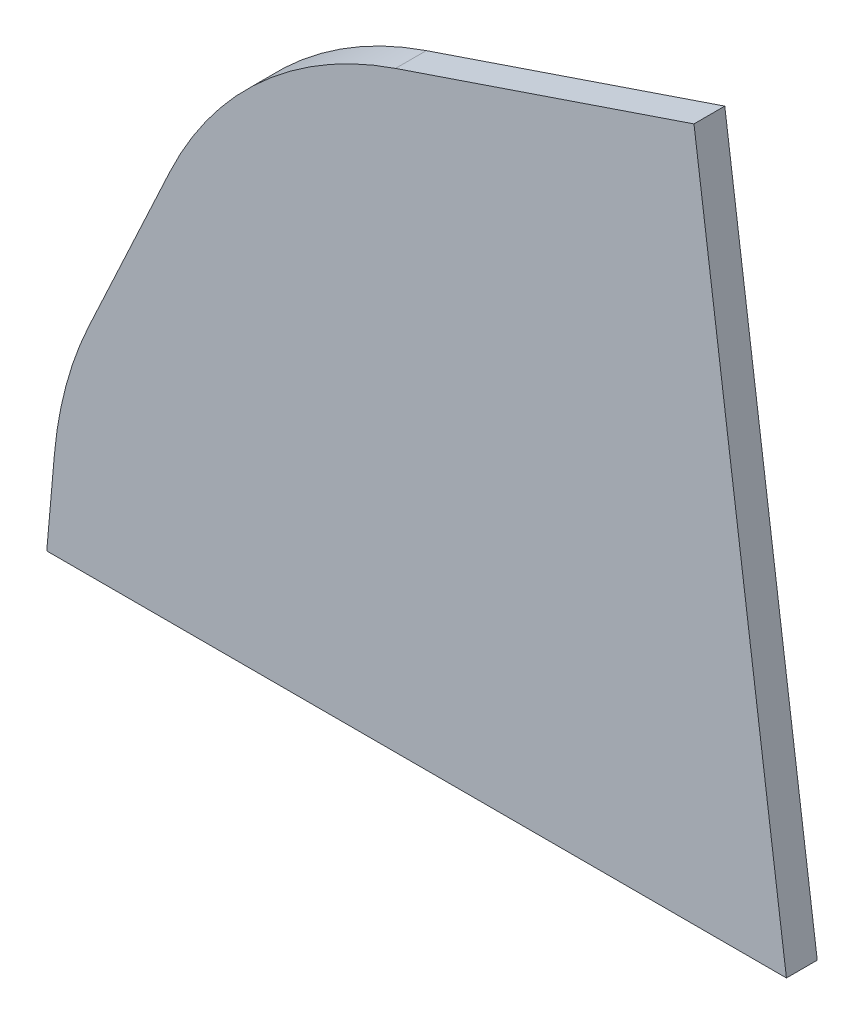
ISO-10303-21;
HEADER;
FILE_DESCRIPTION(('STEP AP214'),'2;1');
FILE_NAME('part.step','',(''),(''),'','','');
FILE_SCHEMA(('AUTOMOTIVE_DESIGN { 1 0 10303 214 1 1 1 1 }'));
ENDSEC;
DATA;
#1=APPLICATION_CONTEXT('core data for automotive mechanical design processes');
#2=APPLICATION_PROTOCOL_DEFINITION('international standard','automotive_design',2000,#1);
#3=PRODUCT_CONTEXT('',#1,'mechanical');
#4=PRODUCT('Part','Part','',(#3));
#5=PRODUCT_RELATED_PRODUCT_CATEGORY('part','',(#4));
#6=PRODUCT_DEFINITION_FORMATION('','',#4);
#7=PRODUCT_DEFINITION_CONTEXT('part definition',#1,'design');
#8=PRODUCT_DEFINITION('design','',#6,#7);
#9=PRODUCT_DEFINITION_SHAPE('','',#8);
#10=(LENGTH_UNIT() NAMED_UNIT(*) SI_UNIT(.MILLI.,.METRE.));
#11=(NAMED_UNIT(*) PLANE_ANGLE_UNIT() SI_UNIT($,.RADIAN.));
#12=(NAMED_UNIT(*) SI_UNIT($,.STERADIAN.) SOLID_ANGLE_UNIT());
#13=UNCERTAINTY_MEASURE_WITH_UNIT(LENGTH_MEASURE(1.E-05),#10,'distance_accuracy_value','');
#14=(GEOMETRIC_REPRESENTATION_CONTEXT(3) GLOBAL_UNCERTAINTY_ASSIGNED_CONTEXT((#13)) GLOBAL_UNIT_ASSIGNED_CONTEXT((#10,
#11,#12)) REPRESENTATION_CONTEXT('',''));
#15=CARTESIAN_POINT('',(0.,0.,0.));
#16=DIRECTION('',(0.,0.,1.));
#17=DIRECTION('',(1.,0.,0.));
#18=AXIS2_PLACEMENT_3D('',#15,#16,#17);
#19=CARTESIAN_POINT('',(-96.,0.,2.));
#20=DIRECTION('',(0.,1.,0.));
#21=DIRECTION('',(0.,0.,1.));
#22=AXIS2_PLACEMENT_3D('',#19,#20,#21);
#23=PLANE('',#22);
#24=DIRECTION('',(1.,0.,0.));
#25=VECTOR('',#24,1.);
#26=CARTESIAN_POINT('',(-96.,0.,-2.));
#27=LINE('',#26,#25);
#28=CARTESIAN_POINT('',(-96.,0.,-2.));
#29=VERTEX_POINT('',#28);
#30=CARTESIAN_POINT('',(0.,0.,-2.));
#31=VERTEX_POINT('',#30);
#32=EDGE_CURVE('E116',#29,#31,#27,.T.);
#33=ORIENTED_EDGE('',*,*,#32,.T.);
#34=DIRECTION('',(0.,0.,-1.));
#35=VECTOR('',#34,1.);
#36=CARTESIAN_POINT('',(0.,0.,2.));
#37=LINE('',#36,#35);
#38=CARTESIAN_POINT('',(0.,0.,2.));
#39=VERTEX_POINT('',#38);
#40=EDGE_CURVE('E100',#39,#31,#37,.T.);
#41=ORIENTED_EDGE('',*,*,#40,.F.);
#42=DIRECTION('',(1.,0.,0.));
#43=VECTOR('',#42,1.);
#44=CARTESIAN_POINT('',(-96.,0.,2.));
#45=LINE('',#44,#43);
#46=CARTESIAN_POINT('',(-96.,0.,2.));
#47=VERTEX_POINT('',#46);
#48=EDGE_CURVE('E105',#47,#39,#45,.T.);
#49=ORIENTED_EDGE('',*,*,#48,.F.);
#50=DIRECTION('',(0.,0.,-1.));
#51=VECTOR('',#50,1.);
#52=CARTESIAN_POINT('',(-96.,0.,2.));
#53=LINE('',#52,#51);
#54=EDGE_CURVE('E121',#47,#29,#53,.T.);
#55=ORIENTED_EDGE('',*,*,#54,.T.);
#56=EDGE_LOOP('',(#33,#41,#49,#55));
#57=FACE_BOUND('',#56,.T.);
#58=ADVANCED_FACE('F34',(#57),#23,.F.);
#59=CARTESIAN_POINT('',(0.,0.,2.));
#60=DIRECTION('',(-0.991227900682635,-0.132163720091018,0.));
#61=DIRECTION('',(0.132163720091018,-0.991227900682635,0.));
#62=AXIS2_PLACEMENT_3D('',#59,#60,#61);
#63=PLANE('',#62);
#64=DIRECTION('',(-0.132163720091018,0.991227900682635,0.));
#65=VECTOR('',#64,1.);
#66=CARTESIAN_POINT('',(0.,0.,-2.));
#67=LINE('',#66,#65);
#68=CARTESIAN_POINT('',(-12.,90.,-2.));
#69=VERTEX_POINT('',#68);
#70=EDGE_CURVE('E150',#31,#69,#67,.T.);
#71=ORIENTED_EDGE('',*,*,#70,.T.);
#72=DIRECTION('',(0.,0.,-1.));
#73=VECTOR('',#72,1.);
#74=CARTESIAN_POINT('',(-12.,90.,2.));
#75=LINE('',#74,#73);
#76=CARTESIAN_POINT('',(-12.,90.,2.));
#77=VERTEX_POINT('',#76);
#78=EDGE_CURVE('E103',#77,#69,#75,.T.);
#79=ORIENTED_EDGE('',*,*,#78,.F.);
#80=DIRECTION('',(-0.132163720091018,0.991227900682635,0.));
#81=VECTOR('',#80,1.);
#82=CARTESIAN_POINT('',(0.,0.,2.));
#83=LINE('',#82,#81);
#84=EDGE_CURVE('E96',#39,#77,#83,.T.);
#85=ORIENTED_EDGE('',*,*,#84,.F.);
#86=ORIENTED_EDGE('',*,*,#40,.T.);
#87=EDGE_LOOP('',(#71,#79,#85,#86));
#88=FACE_BOUND('',#87,.T.);
#89=ADVANCED_FACE('F98',(#88),#63,.F.);
#90=CARTESIAN_POINT('',(-12.,90.,2.));
#91=DIRECTION('',(0.321039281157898,-0.947065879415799,0.));
#92=DIRECTION('',(0.947065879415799,0.321039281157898,0.));
#93=AXIS2_PLACEMENT_3D('',#90,#91,#92);
#94=PLANE('',#93);
#95=DIRECTION('',(-0.947065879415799,-0.321039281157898,0.));
#96=VECTOR('',#95,1.);
#97=CARTESIAN_POINT('',(-12.,90.,-2.));
#98=LINE('',#97,#96);
#99=CARTESIAN_POINT('',(-50.7358599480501,76.8692000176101,-2.));
#100=VERTEX_POINT('',#99);
#101=EDGE_CURVE('E147',#69,#100,#98,.T.);
#102=ORIENTED_EDGE('',*,*,#101,.T.);
#103=DIRECTION('',(0.,0.,-1.));
#104=VECTOR('',#103,1.);
#105=CARTESIAN_POINT('',(-50.7358599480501,76.8692000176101,2.));
#106=LINE('',#105,#104);
#107=CARTESIAN_POINT('',(-50.7358599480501,76.8692000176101,2.));
#108=VERTEX_POINT('',#107);
#109=EDGE_CURVE('E57',#100,#108,#106,.F.);
#110=ORIENTED_EDGE('',*,*,#109,.T.);
#111=DIRECTION('',(-0.947065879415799,-0.321039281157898,0.));
#112=VECTOR('',#111,1.);
#113=CARTESIAN_POINT('',(-12.,90.,2.));
#114=LINE('',#113,#112);
#115=EDGE_CURVE('E104',#77,#108,#114,.T.);
#116=ORIENTED_EDGE('',*,*,#115,.F.);
#117=ORIENTED_EDGE('',*,*,#78,.T.);
#118=EDGE_LOOP('',(#102,#110,#116,#117));
#119=FACE_BOUND('',#118,.T.);
#120=ADVANCED_FACE('F149',(#119),#94,.F.);
#121=CARTESIAN_POINT('',(-71.,70.,2.));
#122=DIRECTION('',(0.906759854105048,-0.421647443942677,0.));
#123=DIRECTION('',(0.421647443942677,0.906759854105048,0.));
#124=AXIS2_PLACEMENT_3D('',#121,#122,#123);
#125=PLANE('',#124);
#126=DIRECTION('',(-0.421647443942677,-0.906759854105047,0.));
#127=VECTOR('',#126,1.);
#128=CARTESIAN_POINT('',(-71.,70.,2.));
#129=LINE('',#128,#127);
#130=CARTESIAN_POINT('',(-80.0218885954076,50.598278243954,2.));
#131=VERTEX_POINT('',#130);
#132=CARTESIAN_POINT('',(-90.5444742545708,27.9692824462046,2.));
#133=VERTEX_POINT('',#132);
#134=EDGE_CURVE('E134',#131,#133,#129,.T.);
#135=ORIENTED_EDGE('',*,*,#134,.F.);
#136=DIRECTION('',(0.,0.,-1.));
#137=VECTOR('',#136,1.);
#138=CARTESIAN_POINT('',(-80.0218885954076,50.598278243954,2.));
#139=LINE('',#138,#137);
#140=CARTESIAN_POINT('',(-80.0218885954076,50.598278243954,-2.));
#141=VERTEX_POINT('',#140);
#142=EDGE_CURVE('E119',#131,#141,#139,.T.);
#143=ORIENTED_EDGE('',*,*,#142,.T.);
#144=DIRECTION('',(-0.421647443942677,-0.906759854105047,0.));
#145=VECTOR('',#144,1.);
#146=CARTESIAN_POINT('',(-71.,70.,-2.));
#147=LINE('',#146,#145);
#148=CARTESIAN_POINT('',(-90.5444742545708,27.9692824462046,-2.));
#149=VERTEX_POINT('',#148);
#150=EDGE_CURVE('E148',#141,#149,#147,.T.);
#151=ORIENTED_EDGE('',*,*,#150,.T.);
#152=DIRECTION('',(0.,0.,-1.));
#153=VECTOR('',#152,1.);
#154=CARTESIAN_POINT('',(-90.5444742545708,27.9692824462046,2.));
#155=LINE('',#154,#153);
#156=EDGE_CURVE('E117',#149,#133,#155,.F.);
#157=ORIENTED_EDGE('',*,*,#156,.T.);
#158=EDGE_LOOP('',(#135,#143,#151,#157));
#159=FACE_BOUND('',#158,.T.);
#160=ADVANCED_FACE('F138',(#159),#125,.F.);
#161=CARTESIAN_POINT('',(-94.2502267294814,20.,2.));
#162=DIRECTION('',(0.996194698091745,-0.0871557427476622,0.));
#163=DIRECTION('',(0.0871557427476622,0.996194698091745,0.));
#164=AXIS2_PLACEMENT_3D('',#161,#162,#163);
#165=PLANE('',#164);
#166=DIRECTION('',(-0.0871557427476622,-0.996194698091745,0.));
#167=VECTOR('',#166,1.);
#168=CARTESIAN_POINT('',(-94.2502267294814,20.,2.));
#169=LINE('',#168,#167);
#170=CARTESIAN_POINT('',(-95.0162164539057,11.2446973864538,2.));
#171=VERTEX_POINT('',#170);
#172=EDGE_CURVE('E109',#171,#47,#169,.T.);
#173=ORIENTED_EDGE('',*,*,#172,.F.);
#174=DIRECTION('',(0.,0.,-1.));
#175=VECTOR('',#174,1.);
#176=CARTESIAN_POINT('',(-95.0162164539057,11.2446973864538,2.));
#177=LINE('',#176,#175);
#178=CARTESIAN_POINT('',(-95.0162164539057,11.2446973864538,-2.));
#179=VERTEX_POINT('',#178);
#180=EDGE_CURVE('E11',#171,#179,#177,.T.);
#181=ORIENTED_EDGE('',*,*,#180,.T.);
#182=DIRECTION('',(-0.0871557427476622,-0.996194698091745,0.));
#183=VECTOR('',#182,1.);
#184=CARTESIAN_POINT('',(-94.2502267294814,20.,-2.));
#185=LINE('',#184,#183);
#186=EDGE_CURVE('E113',#179,#29,#185,.T.);
#187=ORIENTED_EDGE('',*,*,#186,.T.);
#188=ORIENTED_EDGE('',*,*,#54,.F.);
#189=EDGE_LOOP('',(#173,#181,#187,#188));
#190=FACE_BOUND('',#189,.T.);
#191=ADVANCED_FACE('F160',(#190),#165,.F.);
#192=CARTESIAN_POINT('',(-96.,0.,2.));
#193=DIRECTION('',(0.,0.,-1.));
#194=DIRECTION('',(-1.,0.,0.));
#195=AXIS2_PLACEMENT_3D('',#192,#193,#194);
#196=PLANE('',#195);
#197=ORIENTED_EDGE('',*,*,#115,.T.);
#198=CARTESIAN_POINT('',(-34.6838958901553,29.5159060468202,2.));
#199=DIRECTION('',(0.,0.,-1.));
#200=DIRECTION('',(-1.,0.,0.));
#201=AXIS2_PLACEMENT_3D('',#198,#199,#200);
#202=CIRCLE('',#201,50.);
#203=EDGE_CURVE('E42',#108,#131,#202,.F.);
#204=ORIENTED_EDGE('',*,*,#203,.T.);
#205=ORIENTED_EDGE('',*,*,#134,.T.);
#206=CARTESIAN_POINT('',(-45.2064815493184,6.88691024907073,2.));
#207=DIRECTION('',(0.,0.,-1.));
#208=DIRECTION('',(-1.,0.,0.));
#209=AXIS2_PLACEMENT_3D('',#206,#207,#208);
#210=CIRCLE('',#209,50.);
#211=EDGE_CURVE('E49',#133,#171,#210,.F.);
#212=ORIENTED_EDGE('',*,*,#211,.T.);
#213=ORIENTED_EDGE('',*,*,#172,.T.);
#214=ORIENTED_EDGE('',*,*,#48,.T.);
#215=ORIENTED_EDGE('',*,*,#84,.T.);
#216=EDGE_LOOP('',(#197,#204,#205,#212,#213,#214,#215));
#217=FACE_BOUND('',#216,.T.);
#218=ADVANCED_FACE('F108',(#217),#196,.F.);
#219=CARTESIAN_POINT('',(-96.,0.,-2.));
#220=DIRECTION('',(0.,0.,-1.));
#221=DIRECTION('',(-1.,0.,0.));
#222=AXIS2_PLACEMENT_3D('',#219,#220,#221);
#223=PLANE('',#222);
#224=ORIENTED_EDGE('',*,*,#150,.F.);
#225=CARTESIAN_POINT('',(-34.6838958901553,29.5159060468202,-2.));
#226=DIRECTION('',(0.,0.,-1.));
#227=DIRECTION('',(-1.,0.,0.));
#228=AXIS2_PLACEMENT_3D('',#225,#226,#227);
#229=CIRCLE('',#228,50.);
#230=EDGE_CURVE('E129',#141,#100,#229,.T.);
#231=ORIENTED_EDGE('',*,*,#230,.T.);
#232=ORIENTED_EDGE('',*,*,#101,.F.);
#233=ORIENTED_EDGE('',*,*,#70,.F.);
#234=ORIENTED_EDGE('',*,*,#32,.F.);
#235=ORIENTED_EDGE('',*,*,#186,.F.);
#236=CARTESIAN_POINT('',(-45.2064815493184,6.88691024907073,-2.));
#237=DIRECTION('',(0.,0.,-1.));
#238=DIRECTION('',(-1.,0.,0.));
#239=AXIS2_PLACEMENT_3D('',#236,#237,#238);
#240=CIRCLE('',#239,50.);
#241=EDGE_CURVE('E127',#179,#149,#240,.T.);
#242=ORIENTED_EDGE('',*,*,#241,.T.);
#243=EDGE_LOOP('',(#224,#231,#232,#233,#234,#235,#242));
#244=FACE_BOUND('',#243,.T.);
#245=ADVANCED_FACE('F146',(#244),#223,.T.);
#246=CARTESIAN_POINT('',(-34.6838958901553,29.5159060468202,2.));
#247=DIRECTION('',(0.,0.,-1.));
#248=DIRECTION('',(-1.,0.,0.));
#249=AXIS2_PLACEMENT_3D('',#246,#247,#248);
#250=CYLINDRICAL_SURFACE('',#249,50.);
#251=ORIENTED_EDGE('',*,*,#203,.F.);
#252=ORIENTED_EDGE('',*,*,#109,.F.);
#253=ORIENTED_EDGE('',*,*,#230,.F.);
#254=ORIENTED_EDGE('',*,*,#142,.F.);
#255=EDGE_LOOP('',(#251,#252,#253,#254));
#256=FACE_BOUND('',#255,.T.);
#257=ADVANCED_FACE('F143',(#256),#250,.T.);
#258=CARTESIAN_POINT('',(-45.2064815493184,6.88691024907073,2.));
#259=DIRECTION('',(0.,0.,-1.));
#260=DIRECTION('',(-1.,0.,0.));
#261=AXIS2_PLACEMENT_3D('',#258,#259,#260);
#262=CYLINDRICAL_SURFACE('',#261,50.);
#263=ORIENTED_EDGE('',*,*,#211,.F.);
#264=ORIENTED_EDGE('',*,*,#156,.F.);
#265=ORIENTED_EDGE('',*,*,#241,.F.);
#266=ORIENTED_EDGE('',*,*,#180,.F.);
#267=EDGE_LOOP('',(#263,#264,#265,#266));
#268=FACE_BOUND('',#267,.T.);
#269=ADVANCED_FACE('F36',(#268),#262,.T.);
#270=CLOSED_SHELL('',(#58,#89,#120,#160,#191,#218,#245,#257,#269));
#271=MANIFOLD_SOLID_BREP('B2',#270);
#272=ADVANCED_BREP_SHAPE_REPRESENTATION('',(#18,#271),#14);
#273=SHAPE_DEFINITION_REPRESENTATION(#9,#272);
ENDSEC;
END-ISO-10303-21;
